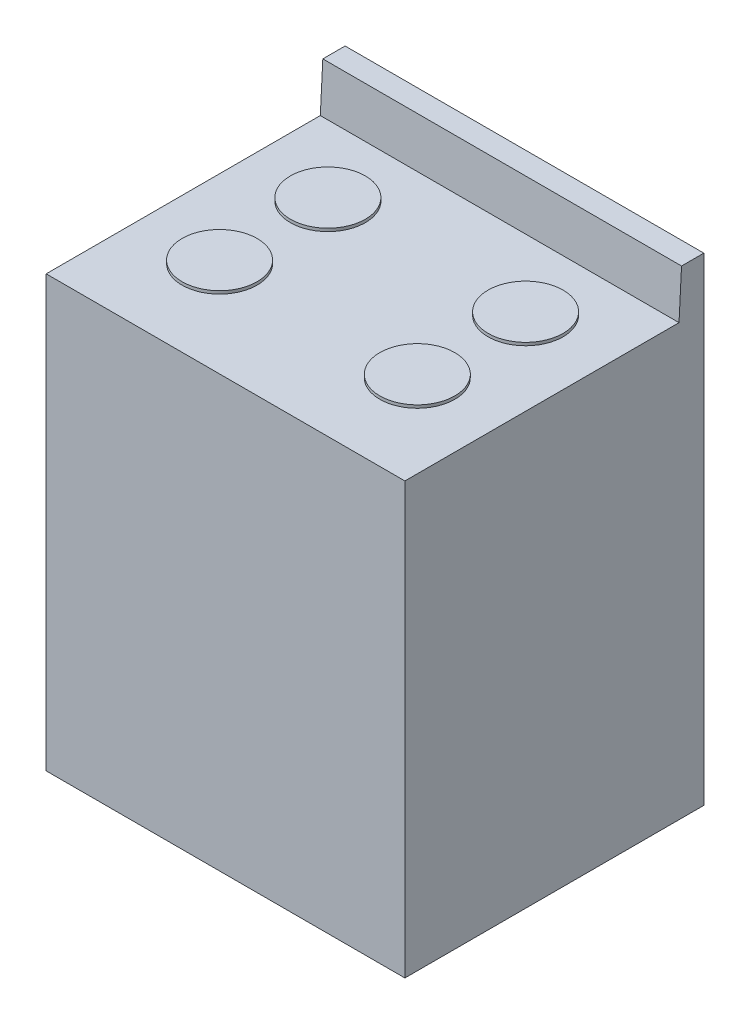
from build123d import *

# Parameters (mm, degrees)
SKETCH1_W            = 762
SKETCH1_H            = 914.4
BOSS_EXTRUDE1_DEPTH  = 635
SKETCH2_W            = 762
SKETCH2_H            = 47.366702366
BOSS_EXTRUDE2_DEPTH  = 101.6
DRAFT1_ANGLE         = 3
SKETCH3_R            = 79.674940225
BOSS_EXTRUDE3_DEPTH  = 6.35
LPATTERN1_COUNT      = 2
LPATTERN1_PITCH      = 420
LPATTERN1_COUNT_DIR2 = 2
LPATTERN1_PITCH_DIR2 = 230


with BuildPart() as part:
    # Sketch1 → Boss-Extrude1 (new body)
    with BuildSketch(Plane.XY):
        with Locations((343.394111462, -430.317665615)):
            Rectangle(SKETCH1_W, SKETCH1_H)
    extrude(amount=BOSS_EXTRUDE1_DEPTH)

    # Sketch2 → Boss-Extrude2 (add)
    with BuildSketch(Plane(origin=(0, 26.882334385, 0), x_dir=(1, 0, 0), z_dir=(0, 1, 0))):
        with Locations((343.394111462, -23.683351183)):
            Rectangle(SKETCH2_W, SKETCH2_H)
    extrude(amount=BOSS_EXTRUDE2_DEPTH)

    # Draft1
    draft1_faces = [part.faces().sort_by_distance(p)[0] for p in [
        (343.394111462, 77.682334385, 47.366702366),
    ]]
    draft(draft1_faces, Plane(origin=(-37.605888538, 128.482334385, 47.366702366), x_dir=(0, 0, 1), z_dir=(0, 1, 0)), DRAFT1_ANGLE)

    # Sketch3 → Boss-Extrude3 (add)
    with BuildSketch(Plane(origin=(0, 26.882334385, 0), x_dir=(1, 0, 0), z_dir=(0, 1, 0))):
        with Locations(Location((127.659294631, -201.890902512, 0), (0, 0, 90))):
            Circle(SKETCH3_R)
    boss_extrude3 = extrude(amount=BOSS_EXTRUDE3_DEPTH)

    # LPattern1: Boss-Extrude3 2 × 2
    with Locations(*[(i * LPATTERN1_PITCH, 0, j * LPATTERN1_PITCH_DIR2) for i in range(LPATTERN1_COUNT) for j in range(LPATTERN1_COUNT_DIR2) if (i, j) != (0, 0)]):
        add(boss_extrude3)


solid = part.part
